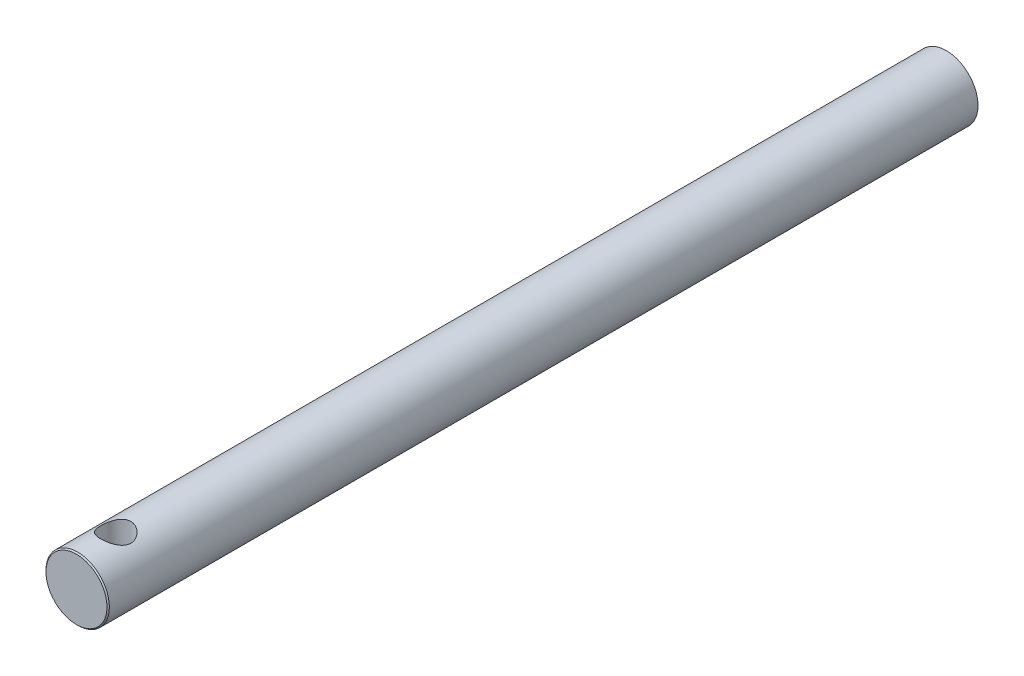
from build123d import *

# Parameters (mm, degrees)
ESQUISSE1_R                  = 5.25
EXTRUSION1_DEPTH             = 144
CHANFREIN1_SIZE              = 0.2
ENL_V_MAT_EXTRU_1_DEPTH      = 145.191279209
ENL_V_MAT_EXTRU_1_DEPTH_BACK = 145.191279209
ESQUISSE2_R                  = 2.5


with BuildPart() as part:
    # Esquisse1 → Extrusion1 (new body)
    with BuildSketch(Plane.XY):
        Circle(ESQUISSE1_R)
    extrude(amount=EXTRUSION1_DEPTH)

    # Chanfrein1
    chanfrein1_edges = [part.edges().sort_by_distance(p)[0] for p in [
        (-5.25, 0, 144),
    ]]
    chamfer(chanfrein1_edges, length=CHANFREIN1_SIZE)

    # Esquisse2 → Enl_v. mat.-Extru.1 (cut, two sides: drawn at the far end of the back side and taken through both)
    with BuildSketch(Plane(origin=(0, 0, 0), x_dir=(1, 0, 0), z_dir=(0, 1, 0)).offset(-ENL_V_MAT_EXTRU_1_DEPTH_BACK)):
        with Locations(Location((0, -137.5, 0), (0, 0, 270))):
            Circle(ESQUISSE2_R)
    extrude(amount=ENL_V_MAT_EXTRU_1_DEPTH + ENL_V_MAT_EXTRU_1_DEPTH_BACK, mode=Mode.SUBTRACT)


solid = part.part
